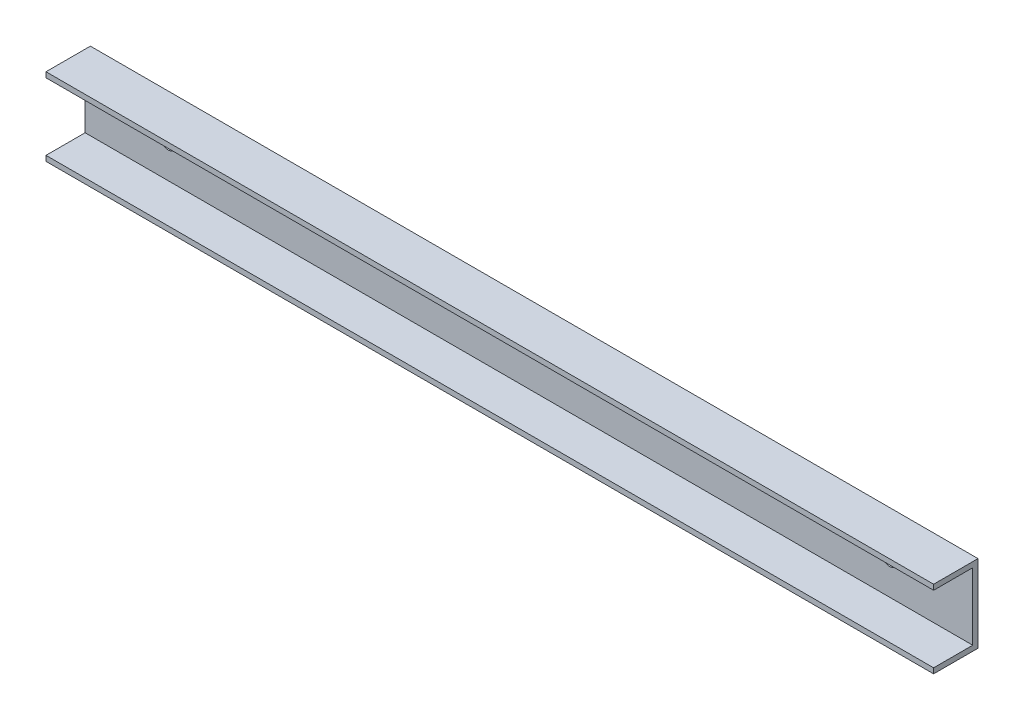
from build123d import *

# Parameters (mm, degrees)
CROQUIS1_W              = 320
CROQUIS1_H              = 24.2
SALIENTE_EXTRUIR1_DEPTH = 1.9
CROQUIS1_3_W            = 320
CROQUIS1_3_H            = 1.9
SALIENTE_EXTRUIR2_DEPTH = 16
CROQUIS2_R              = 2.5
CORTAR_EXTRUIR1_DEPTH   = 1.9


with BuildPart() as part:
    # Croquis1 → Saliente-Extruir1 (new body)
    with BuildSketch(Plane.XY):
        with Locations((160, -12.1)):
            Rectangle(CROQUIS1_W, CROQUIS1_H)
    extrude(amount=SALIENTE_EXTRUIR1_DEPTH)

    # Croquis1_3 → Saliente-Extruir2 (add)
    with BuildSketch(Plane.XY):
        with Locations((160, -25.15)):
            Rectangle(CROQUIS1_3_W, CROQUIS1_3_H)
        with Locations((160, 0.95)):
            Rectangle(CROQUIS1_3_W, CROQUIS1_3_H)
    extrude(amount=SALIENTE_EXTRUIR2_DEPTH)

    # Croquis2 → Cortar-Extruir1 (cut)
    with BuildSketch(Plane.XY.offset(1.9)):
        with Locations((30, -12.1)):
            Circle(CROQUIS2_R)
        with Locations((290, -12.1)):
            Circle(CROQUIS2_R)
    extrude(amount=-CORTAR_EXTRUIR1_DEPTH, mode=Mode.SUBTRACT)


solid = part.part
